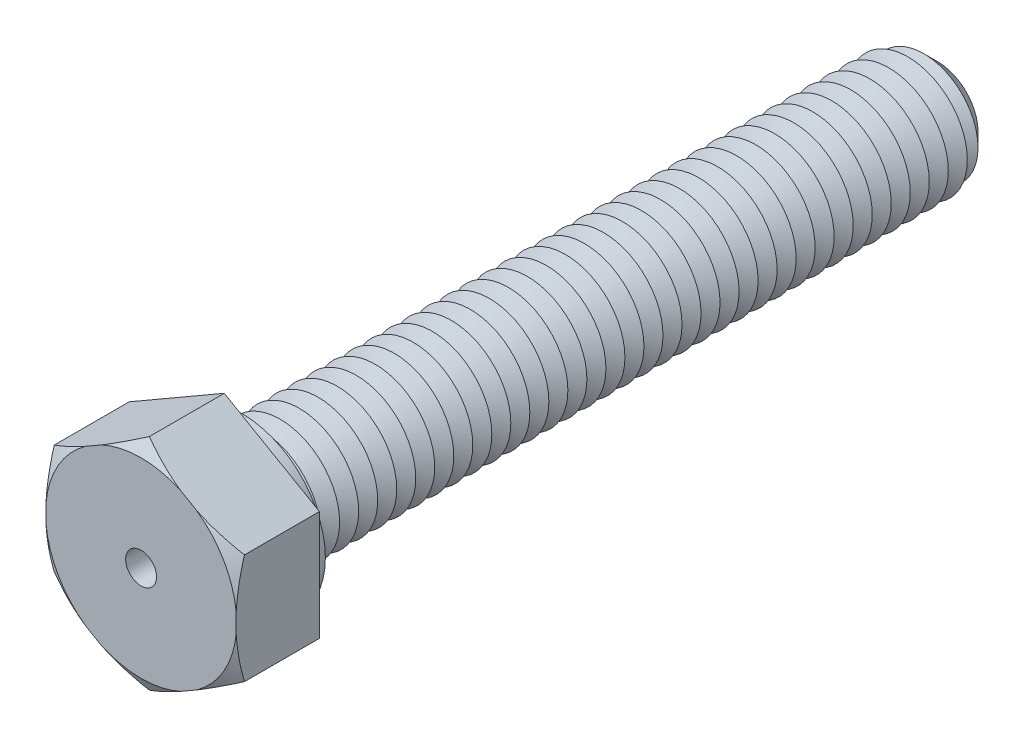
from build123d import *

# Parameters (mm, degrees)
BOSS_EXTRUDE1_DEPTH = 3.5
SKETCH3_R           = 2.5
BOSS_EXTRUDE2_DEPTH = 30
SKETCH4_R           = 3.5
BOSS_EXTRUDE3_DEPTH = 0.75
CHAMFER1_SIZE       = 0.8
LPATTERN1_COUNT     = 36
LPATTERN1_PITCH     = 0.8
SKETCH8_R           = 0.65
CUT_EXTRUDE1_DEPTH  = 33.5


with BuildPart() as part:
    # Sketch2 → Boss-Extrude1 (new body)
    with BuildSketch(Plane.XY):
        Polygon((0, 4.618802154), (-4, 2.309401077), (-4, -2.309401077), (0, -4.618802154), (4, -2.309401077), (4, 2.309401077), align=None)
    extrude(amount=BOSS_EXTRUDE1_DEPTH)

    # Sketch3 → Boss-Extrude2 (add)
    with BuildSketch(Plane(origin=(0, 0, 0), x_dir=(-1, 0, 0), z_dir=(0, 0, -1))):
        Circle(SKETCH3_R)
    extrude(amount=BOSS_EXTRUDE2_DEPTH)

    # Sketch4 → Boss-Extrude3 (add)
    with BuildSketch(Plane(origin=(0, 0, 0), x_dir=(-1, 0, 0), z_dir=(0, 0, -1))):
        with Locations(Location((0, 0, 0), (0, 0, 180))):
            Circle(SKETCH4_R)
    extrude(amount=BOSS_EXTRUDE3_DEPTH)

    # Chamfer1
    chamfer1_edges = [part.edges().sort_by_distance(p)[0] for p in [
        (2.5, 0, -30),
    ]]
    chamfer(chamfer1_edges, length=CHAMFER1_SIZE)

    # Sketch6 → Cut-Revolve1 (revolve, cut)
    with BuildSketch(Plane(origin=(0, 0, 0), x_dir=(0, 0, -1), z_dir=(1, 0, 0)), mode=Mode.PRIVATE) as cut_revolve1_sk:
        Polygon((0.75, 2.5), (1.15, 1.807179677), (1.55, 2.5), align=None)
    cut_revolve1 = revolve(cut_revolve1_sk.sketch.rotate(Axis((0, 0, 3.211670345), (0, 0, -1)), 90), axis=Axis((0, 0, 3.211670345), (0, 0, -1)), mode=Mode.SUBTRACT)

    # LPattern1: Cut-Revolve1 ×36
    with Locations(*[(0, 0, -i * LPATTERN1_PITCH) for i in range(1, LPATTERN1_COUNT)]):
        add(cut_revolve1, mode=Mode.SUBTRACT)

    # Sketch7 → Cut-Revolve2 (revolve, cut)
    with BuildSketch(Plane(origin=(0, 0, 0), x_dir=(0, 0, -1), z_dir=(1, 0, 0)), mode=Mode.PRIVATE) as cut_revolve2_sk:
        Polygon((-3.5, 4.618802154), (-3.5, 4.018802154), (-3.153589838, 4.618802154), align=None)
    revolve(cut_revolve2_sk.sketch.rotate(Axis((0, 0, 3.211670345), (0, 0, -1)), 270), axis=Axis((0, 0, 3.211670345), (0, 0, -1)), mode=Mode.SUBTRACT)

    # Sketch8 → Cut-Extrude1 (cut)
    with BuildSketch(Plane.XY.offset(3.5)):
        Circle(SKETCH8_R)
    extrude(amount=-CUT_EXTRUDE1_DEPTH, mode=Mode.SUBTRACT)


solid = part.part
